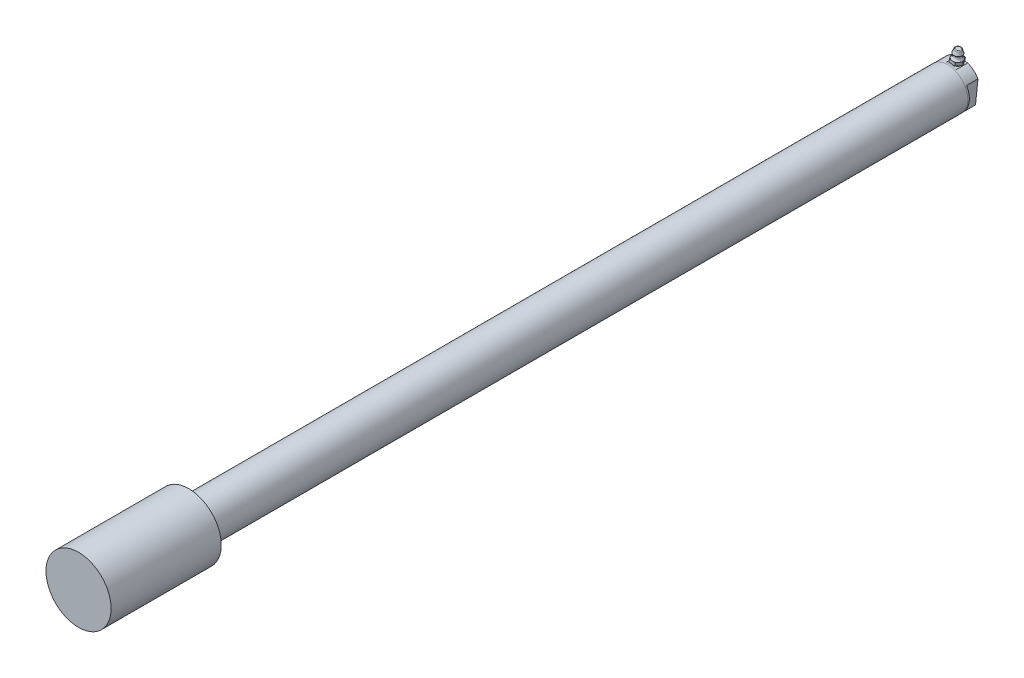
ISO-10303-21;
HEADER;
FILE_DESCRIPTION(('STEP AP214'),'2;1');
FILE_NAME('part.step','',(''),(''),'','','');
FILE_SCHEMA(('AUTOMOTIVE_DESIGN { 1 0 10303 214 1 1 1 1 }'));
ENDSEC;
DATA;
#1=APPLICATION_CONTEXT('core data for automotive mechanical design processes');
#2=APPLICATION_PROTOCOL_DEFINITION('international standard','automotive_design',2000,#1);
#3=PRODUCT_CONTEXT('',#1,'mechanical');
#4=PRODUCT('Part','Part','',(#3));
#5=PRODUCT_RELATED_PRODUCT_CATEGORY('part','',(#4));
#6=PRODUCT_DEFINITION_FORMATION('','',#4);
#7=PRODUCT_DEFINITION_CONTEXT('part definition',#1,'design');
#8=PRODUCT_DEFINITION('design','',#6,#7);
#9=PRODUCT_DEFINITION_SHAPE('','',#8);
#10=(LENGTH_UNIT() NAMED_UNIT(*) SI_UNIT(.MILLI.,.METRE.));
#11=(NAMED_UNIT(*) PLANE_ANGLE_UNIT() SI_UNIT($,.RADIAN.));
#12=(NAMED_UNIT(*) SI_UNIT($,.STERADIAN.) SOLID_ANGLE_UNIT());
#13=UNCERTAINTY_MEASURE_WITH_UNIT(LENGTH_MEASURE(1.E-05),#10,'distance_accuracy_value','');
#14=(GEOMETRIC_REPRESENTATION_CONTEXT(3) GLOBAL_UNCERTAINTY_ASSIGNED_CONTEXT((#13)) GLOBAL_UNIT_ASSIGNED_CONTEXT((#10,
#11,#12)) REPRESENTATION_CONTEXT('',''));
#15=CARTESIAN_POINT('',(0.,0.,0.));
#16=DIRECTION('',(0.,0.,1.));
#17=DIRECTION('',(1.,0.,0.));
#18=AXIS2_PLACEMENT_3D('',#15,#16,#17);
#19=CARTESIAN_POINT('',(0.,0.,614.74460000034));
#20=DIRECTION('',(0.,0.,-1.));
#21=DIRECTION('',(-1.,0.,0.));
#22=AXIS2_PLACEMENT_3D('',#19,#20,#21);
#23=CYLINDRICAL_SURFACE('',#22,15.8496);
#24=CARTESIAN_POINT('',(0.,0.,602.29860000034));
#25=DIRECTION('',(0.,0.,-1.));
#26=DIRECTION('',(-1.,0.,0.));
#27=AXIS2_PLACEMENT_3D('',#24,#25,#26);
#28=CIRCLE('',#27,15.8496);
#29=CARTESIAN_POINT('',(-15.8496,0.,602.29860000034));
#30=VERTEX_POINT('',#29);
#31=EDGE_CURVE('E861',#30,#30,#28,.F.);
#32=ORIENTED_EDGE('',*,*,#31,.F.);
#33=EDGE_LOOP('',(#32));
#34=FACE_BOUND('',#33,.T.);
#35=CARTESIAN_POINT('',(0.,0.,10.16));
#36=DIRECTION('',(0.,0.,-1.));
#37=DIRECTION('',(-1.,0.,0.));
#38=AXIS2_PLACEMENT_3D('',#35,#36,#37);
#39=CIRCLE('',#38,15.8496);
#40=CARTESIAN_POINT('',(-15.8496,0.,10.16));
#41=VERTEX_POINT('',#40);
#42=EDGE_CURVE('E858',#41,#41,#39,.T.);
#43=ORIENTED_EDGE('',*,*,#42,.F.);
#44=EDGE_LOOP('',(#43));
#45=FACE_BOUND('',#44,.T.);
#46=ADVANCED_FACE('F17',(#34,#45),#23,.T.);
#47=CARTESIAN_POINT('',(0.,0.,10.16));
#48=DIRECTION('',(0.,0.,-1.));
#49=DIRECTION('',(-1.,0.,0.));
#50=AXIS2_PLACEMENT_3D('',#47,#48,#49);
#51=PLANE('',#50);
#52=CARTESIAN_POINT('',(0.,0.,10.16));
#53=DIRECTION('',(0.,0.,-1.));
#54=DIRECTION('',(0.,1.,0.));
#55=AXIS2_PLACEMENT_3D('',#52,#53,#54);
#56=CIRCLE('',#55,15.7607);
#57=CARTESIAN_POINT('',(0.,15.7607,10.16));
#58=VERTEX_POINT('',#57);
#59=EDGE_CURVE('E10',#58,#58,#56,.T.);
#60=ORIENTED_EDGE('',*,*,#59,.F.);
#61=EDGE_LOOP('',(#60));
#62=FACE_BOUND('',#61,.T.);
#63=ORIENTED_EDGE('',*,*,#42,.T.);
#64=EDGE_LOOP('',(#63));
#65=FACE_BOUND('',#64,.T.);
#66=ADVANCED_FACE('F361',(#62,#65),#51,.T.);
#67=CARTESIAN_POINT('',(0.,0.,602.29860000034));
#68=DIRECTION('',(0.,0.,-1.));
#69=DIRECTION('',(-1.,0.,0.));
#70=AXIS2_PLACEMENT_3D('',#67,#68,#69);
#71=PLANE('',#70);
#72=ORIENTED_EDGE('',*,*,#31,.T.);
#73=EDGE_LOOP('',(#72));
#74=FACE_BOUND('',#73,.T.);
#75=CARTESIAN_POINT('',(0.,0.,602.29860000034));
#76=DIRECTION('',(0.,0.,-1.));
#77=DIRECTION('',(-1.,0.,0.));
#78=AXIS2_PLACEMENT_3D('',#75,#76,#77);
#79=CIRCLE('',#78,25.4);
#80=CARTESIAN_POINT('',(-25.4,0.,602.29860000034));
#81=VERTEX_POINT('',#80);
#82=EDGE_CURVE('E253',#81,#81,#79,.T.);
#83=ORIENTED_EDGE('',*,*,#82,.T.);
#84=EDGE_LOOP('',(#83));
#85=FACE_BOUND('',#84,.T.);
#86=ADVANCED_FACE('F372',(#74,#85),#71,.T.);
#87=CARTESIAN_POINT('',(0.,0.,688.28014000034));
#88=DIRECTION('',(0.,0.,1.));
#89=DIRECTION('',(1.,0.,0.));
#90=AXIS2_PLACEMENT_3D('',#87,#88,#89);
#91=PLANE('',#90);
#92=CARTESIAN_POINT('',(0.,0.,688.28014000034));
#93=DIRECTION('',(0.,0.,1.));
#94=DIRECTION('',(1.,0.,0.));
#95=AXIS2_PLACEMENT_3D('',#92,#93,#94);
#96=CIRCLE('',#95,25.4);
#97=CARTESIAN_POINT('',(25.4,0.,688.28014000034));
#98=VERTEX_POINT('',#97);
#99=EDGE_CURVE('E857',#98,#98,#96,.T.);
#100=ORIENTED_EDGE('',*,*,#99,.T.);
#101=EDGE_LOOP('',(#100));
#102=FACE_BOUND('',#101,.T.);
#103=ADVANCED_FACE('F379',(#102),#91,.T.);
#104=CARTESIAN_POINT('',(0.,0.,688.28014000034));
#105=DIRECTION('',(0.,0.,-1.));
#106=DIRECTION('',(-1.,0.,0.));
#107=AXIS2_PLACEMENT_3D('',#104,#105,#106);
#108=CYLINDRICAL_SURFACE('',#107,25.4);
#109=ORIENTED_EDGE('',*,*,#99,.F.);
#110=EDGE_LOOP('',(#109));
#111=FACE_BOUND('',#110,.T.);
#112=ORIENTED_EDGE('',*,*,#82,.F.);
#113=EDGE_LOOP('',(#112));
#114=FACE_BOUND('',#113,.T.);
#115=ADVANCED_FACE('F388',(#111,#114),#108,.T.);
#116=CARTESIAN_POINT('',(2.6550229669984,25.2608561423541,4.445));
#117=DIRECTION('',(0.104528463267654,0.994521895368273,0.));
#118=DIRECTION('',(0.,0.,1.));
#119=AXIS2_PLACEMENT_3D('',#116,#117,#118);
#120=PLANE('',#119);
#121=CARTESIAN_POINT('',(2.6550229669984,25.2608561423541,4.445));
#122=DIRECTION('',(0.104528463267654,0.994521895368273,0.));
#123=DIRECTION('',(0.,0.,1.));
#124=AXIS2_PLACEMENT_3D('',#121,#122,#123);
#125=CIRCLE('',#124,1.7474960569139);
#126=CARTESIAN_POINT('',(2.6550229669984,25.2608561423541,6.1924960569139));
#127=VERTEX_POINT('',#126);
#128=EDGE_CURVE('E244',#127,#127,#125,.T.);
#129=ORIENTED_EDGE('',*,*,#128,.T.);
#130=EDGE_LOOP('',(#129));
#131=FACE_BOUND('',#130,.T.);
#132=ADVANCED_FACE('F385',(#131),#120,.T.);
#133=CARTESIAN_POINT('',(2.57537227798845,24.5030304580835,4.445));
#134=DIRECTION('',(0.104528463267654,0.994521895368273,0.));
#135=DIRECTION('',(0.,0.,1.));
#136=AXIS2_PLACEMENT_3D('',#133,#134,#135);
#137=TOROIDAL_SURFACE('',#136,1.7474960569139,0.762);
#138=ORIENTED_EDGE('',*,*,#128,.F.);
#139=EDGE_LOOP('',(#138));
#140=FACE_BOUND('',#139,.T.);
#141=CARTESIAN_POINT('',(2.60196343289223,24.7560283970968,4.445));
#142=DIRECTION('',(0.104528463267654,0.994521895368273,0.));
#143=DIRECTION('',(0.,0.,1.));
#144=AXIS2_PLACEMENT_3D('',#141,#142,#143);
#145=CIRCLE('',#144,2.46577800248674);
#146=CARTESIAN_POINT('',(2.60196343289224,24.7560283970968,1.97922199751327));
#147=VERTEX_POINT('',#146);
#148=EDGE_CURVE('E241',#147,#147,#145,.F.);
#149=ORIENTED_EDGE('',*,*,#148,.F.);
#150=EDGE_LOOP('',(#149));
#151=FACE_BOUND('',#150,.T.);
#152=ADVANCED_FACE('F387',(#140,#151),#137,.T.);
#153=CARTESIAN_POINT('',(2.3364202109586,22.2295534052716,4.445));
#154=DIRECTION('',(-0.104528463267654,-0.994521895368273,0.));
#155=DIRECTION('',(0.,0.,-1.));
#156=AXIS2_PLACEMENT_3D('',#153,#154,#155);
#157=CONICAL_SURFACE('',#156,3.3655,0.340381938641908);
#158=CARTESIAN_POINT('',(2.3364202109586,22.2295534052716,4.445));
#159=DIRECTION('',(-0.104528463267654,-0.994521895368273,0.));
#160=DIRECTION('',(0.,0.,-1.));
#161=AXIS2_PLACEMENT_3D('',#158,#159,#160);
#162=CIRCLE('',#161,3.3655);
#163=CARTESIAN_POINT('',(2.3364202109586,22.2295534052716,1.0795));
#164=VERTEX_POINT('',#163);
#165=EDGE_CURVE('E194',#164,#164,#162,.T.);
#166=CARTESIAN_POINT('',(2.60196343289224,24.7560283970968,1.97922199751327));
#167=CARTESIAN_POINT('',(2.59919735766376,24.7297109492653,1.96984989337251));
#168=CARTESIAN_POINT('',(2.59643128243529,24.7033935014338,1.96047778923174));
#169=CARTESIAN_POINT('',(2.59089913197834,24.6507586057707,1.94173358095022));
#170=CARTESIAN_POINT('',(2.58813305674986,24.6244411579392,1.93236147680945));
#171=CARTESIAN_POINT('',(2.58260090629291,24.5718062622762,1.91361726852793));
#172=CARTESIAN_POINT('',(2.57983483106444,24.5454888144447,1.90424516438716));
#173=CARTESIAN_POINT('',(2.57430268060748,24.4928539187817,1.88550095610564));
#174=CARTESIAN_POINT('',(2.57153660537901,24.4665364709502,1.87612885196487));
#175=CARTESIAN_POINT('',(2.56600445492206,24.4139015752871,1.85738464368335));
#176=CARTESIAN_POINT('',(2.56323837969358,24.3875841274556,1.84801253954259));
#177=CARTESIAN_POINT('',(2.55770622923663,24.3349492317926,1.82926833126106));
#178=CARTESIAN_POINT('',(2.55494015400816,24.3086317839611,1.8198962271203));
#179=CARTESIAN_POINT('',(2.54940800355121,24.2559968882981,1.80115201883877));
#180=CARTESIAN_POINT('',(2.54664192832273,24.2296794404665,1.79177991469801));
#181=CARTESIAN_POINT('',(2.54110977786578,24.1770445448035,1.77303570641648));
#182=CARTESIAN_POINT('',(2.5383437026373,24.150727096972,1.76366360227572));
#183=CARTESIAN_POINT('',(2.53281155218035,24.098092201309,1.74491939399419));
#184=CARTESIAN_POINT('',(2.53004547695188,24.0717747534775,1.73554728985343));
#185=CARTESIAN_POINT('',(2.52451332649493,24.0191398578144,1.7168030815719));
#186=CARTESIAN_POINT('',(2.52174725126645,23.9928224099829,1.70743097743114));
#187=CARTESIAN_POINT('',(2.5162151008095,23.9401875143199,1.68868676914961));
#188=CARTESIAN_POINT('',(2.51344902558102,23.9138700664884,1.67931466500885));
#189=CARTESIAN_POINT('',(2.50791687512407,23.8612351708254,1.66057045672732));
#190=CARTESIAN_POINT('',(2.5051507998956,23.8349177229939,1.65119835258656));
#191=CARTESIAN_POINT('',(2.49961864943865,23.7822828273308,1.63245414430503));
#192=CARTESIAN_POINT('',(2.49685257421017,23.7559653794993,1.62308204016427));
#193=CARTESIAN_POINT('',(2.49132042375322,23.7033304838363,1.60433783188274));
#194=CARTESIAN_POINT('',(2.48855434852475,23.6770130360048,1.59496572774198));
#195=CARTESIAN_POINT('',(2.48302219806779,23.6243781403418,1.57622151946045));
#196=CARTESIAN_POINT('',(2.48025612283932,23.5980606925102,1.56684941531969));
#197=CARTESIAN_POINT('',(2.47472397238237,23.5454257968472,1.54810520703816));
#198=CARTESIAN_POINT('',(2.47195789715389,23.5191083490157,1.5387331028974));
#199=CARTESIAN_POINT('',(2.46642574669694,23.4664734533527,1.51998889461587));
#200=CARTESIAN_POINT('',(2.46365967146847,23.4401560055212,1.51061679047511));
#201=CARTESIAN_POINT('',(2.45812752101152,23.3875211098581,1.49187258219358));
#202=CARTESIAN_POINT('',(2.45536144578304,23.3612036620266,1.48250047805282));
#203=CARTESIAN_POINT('',(2.44982929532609,23.3085687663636,1.46375626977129));
#204=CARTESIAN_POINT('',(2.44706322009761,23.2822513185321,1.45438416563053));
#205=CARTESIAN_POINT('',(2.44153106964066,23.2296164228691,1.435639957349));
#206=CARTESIAN_POINT('',(2.43876499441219,23.2032989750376,1.42626785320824));
#207=CARTESIAN_POINT('',(2.43323284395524,23.1506640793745,1.40752364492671));
#208=CARTESIAN_POINT('',(2.43046676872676,23.124346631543,1.39815154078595));
#209=CARTESIAN_POINT('',(2.42493461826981,23.07171173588,1.37940733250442));
#210=CARTESIAN_POINT('',(2.42216854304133,23.0453942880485,1.37003522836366));
#211=CARTESIAN_POINT('',(2.41663639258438,22.9927593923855,1.35129102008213));
#212=CARTESIAN_POINT('',(2.41387031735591,22.9664419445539,1.34191891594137));
#213=CARTESIAN_POINT('',(2.40833816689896,22.9138070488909,1.32317470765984));
#214=CARTESIAN_POINT('',(2.40557209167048,22.8874896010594,1.31380260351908));
#215=CARTESIAN_POINT('',(2.40003994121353,22.8348547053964,1.29505839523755));
#216=CARTESIAN_POINT('',(2.39727386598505,22.8085372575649,1.28568629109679));
#217=CARTESIAN_POINT('',(2.3917417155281,22.7559023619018,1.26694208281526));
#218=CARTESIAN_POINT('',(2.38897564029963,22.7295849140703,1.2575699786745));
#219=CARTESIAN_POINT('',(2.38344348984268,22.6769500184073,1.23882577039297));
#220=CARTESIAN_POINT('',(2.3806774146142,22.6506325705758,1.22945366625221));
#221=CARTESIAN_POINT('',(2.37514526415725,22.5979976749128,1.21070945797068));
#222=CARTESIAN_POINT('',(2.37237918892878,22.5716802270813,1.20133735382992));
#223=CARTESIAN_POINT('',(2.36684703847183,22.5190453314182,1.1825931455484));
#224=CARTESIAN_POINT('',(2.36408096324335,22.4927278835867,1.17322104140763));
#225=CARTESIAN_POINT('',(2.3585488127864,22.4400929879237,1.15447683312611));
#226=CARTESIAN_POINT('',(2.35578273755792,22.4137755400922,1.14510472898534));
#227=CARTESIAN_POINT('',(2.35025058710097,22.3611406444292,1.12636052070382));
#228=CARTESIAN_POINT('',(2.3474845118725,22.3348231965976,1.11698841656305));
#229=CARTESIAN_POINT('',(2.34195236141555,22.2821883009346,1.09824420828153));
#230=CARTESIAN_POINT('',(2.33918628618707,22.2558708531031,1.08887210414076));
#231=CARTESIAN_POINT('',(2.3364202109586,22.2295534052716,1.0795));
#232=B_SPLINE_CURVE_WITH_KNOTS('',3,(#166,#167,#168,#169,#170,#171,#172,#173,#174,#175,#176,
#177,#178,#179,#180,#181,#182,#183,#184,#185,#186,#187,#188,#189,#190,#191,#192,#193,#194,#195,
#196,#197,#198,#199,#200,#201,#202,#203,#204,#205,#206,#207,#208,#209,#210,#211,#212,#213,#214,
#215,#216,#217,#218,#219,#220,#221,#222,#223,#224,#225,#226,#227,#228,#229,#230,#231),
.UNSPECIFIED.,.F.,.F.,(4,2,2,2,2,2,2,2,2,2,2,2,2,2,2,2,2,2,2,2,2,2,2,2,2,2,2,2,2,2,2,2,4),(0.,
0.0842191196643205,0.168438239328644,0.252657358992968,0.336876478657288,0.421095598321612,
0.505314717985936,0.589533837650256,0.67375295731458,0.757972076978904,0.842191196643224,
0.926410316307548,1.01062943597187,1.0948485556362,1.17906767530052,1.26328679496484,
1.34750591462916,1.43172503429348,1.51594415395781,1.60016327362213,1.68438239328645,
1.76860151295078,1.8528206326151,1.93703975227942,2.02125887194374,2.10547799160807,
2.18969711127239,2.27391623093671,2.35813535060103,2.44235447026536,2.52657358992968,
2.610792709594,2.69501182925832),.UNSPECIFIED.);
#233=EDGE_CURVE('BSEAM396',#147,#164,#232,.T.);
#234=ORIENTED_EDGE('',*,*,#148,.T.);
#235=ORIENTED_EDGE('',*,*,#165,.F.);
#236=ORIENTED_EDGE('',*,*,#233,.T.);
#237=ORIENTED_EDGE('',*,*,#233,.F.);
#238=EDGE_LOOP('',(#234,#236,#235,#237));
#239=FACE_BOUND('',#238,.T.);
#240=ADVANCED_FACE('F396',(#239),#157,.T.);
#241=CARTESIAN_POINT('',(2.1693513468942,20.63999934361,4.445));
#242=DIRECTION('',(-0.104528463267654,-0.994521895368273,0.));
#243=DIRECTION('',(0.,0.,-1.));
#244=AXIS2_PLACEMENT_3D('',#241,#242,#243);
#245=TOROIDAL_SURFACE('',#244,5.20693450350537,2.43833450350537);
#246=ORIENTED_EDGE('',*,*,#165,.T.);
#247=EDGE_LOOP('',(#246));
#248=FACE_BOUND('',#247,.T.);
#249=CARTESIAN_POINT('',(1.94978249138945,18.5509412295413,4.445));
#250=DIRECTION('',(-0.104528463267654,-0.994521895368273,0.));
#251=DIRECTION('',(0.,0.,-1.));
#252=AXIS2_PLACEMENT_3D('',#249,#250,#251);
#253=CIRCLE('',#252,3.96875);
#254=CARTESIAN_POINT('',(1.94978249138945,18.5509412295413,0.47625));
#255=VERTEX_POINT('',#254);
#256=CARTESIAN_POINT('',(5.36799235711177,18.191672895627,2.460625));
#257=VERTEX_POINT('',#256);
#258=EDGE_CURVE('E43',#255,#257,#253,.T.);
#259=ORIENTED_EDGE('',*,*,#258,.F.);
#260=CARTESIAN_POINT('',(-1.46842737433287,18.9102095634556,2.460625));
#261=VERTEX_POINT('',#260);
#262=EDGE_CURVE('E190',#261,#255,#253,.T.);
#263=ORIENTED_EDGE('',*,*,#262,.F.);
#264=CARTESIAN_POINT('',(-1.46842737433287,18.9102095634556,6.429375));
#265=VERTEX_POINT('',#264);
#266=EDGE_CURVE('E189',#265,#261,#253,.T.);
#267=ORIENTED_EDGE('',*,*,#266,.F.);
#268=CARTESIAN_POINT('',(1.94978249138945,18.5509412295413,8.41375));
#269=VERTEX_POINT('',#268);
#270=EDGE_CURVE('E169',#269,#265,#253,.T.);
#271=ORIENTED_EDGE('',*,*,#270,.F.);
#272=CARTESIAN_POINT('',(5.36799235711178,18.191672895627,6.429375));
#273=VERTEX_POINT('',#272);
#274=EDGE_CURVE('E158',#273,#269,#253,.T.);
#275=ORIENTED_EDGE('',*,*,#274,.F.);
#276=EDGE_CURVE('E168',#257,#273,#253,.T.);
#277=ORIENTED_EDGE('',*,*,#276,.F.);
#278=EDGE_LOOP('',(#259,#263,#267,#271,#275,#277));
#279=FACE_BOUND('',#278,.T.);
#280=ADVANCED_FACE('F187',(#248,#279),#245,.F.);
#281=CARTESIAN_POINT('',(-0.329024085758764,18.7904534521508,0.47625));
#282=DIRECTION('',(0.104528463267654,0.994521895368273,0.));
#283=DIRECTION('',(0.994521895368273,-0.104528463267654,0.));
#284=AXIS2_PLACEMENT_3D('',#281,#282,#283);
#285=PLANE('',#284);
#286=ORIENTED_EDGE('',*,*,#266,.T.);
#287=DIRECTION('',(-0.497260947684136,0.0522642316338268,0.866025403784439));
#288=VECTOR('',#287,1.);
#289=CARTESIAN_POINT('',(-0.329024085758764,18.7904534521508,0.47625));
#290=LINE('',#289,#288);
#291=CARTESIAN_POINT('',(-2.60783066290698,19.0299656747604,4.445));
#292=VERTEX_POINT('',#291);
#293=EDGE_CURVE('E203',#261,#292,#290,.T.);
#294=ORIENTED_EDGE('',*,*,#293,.T.);
#295=DIRECTION('',(0.497260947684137,-0.0522642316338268,0.866025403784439));
#296=VECTOR('',#295,1.);
#297=CARTESIAN_POINT('',(-2.60783066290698,19.0299656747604,4.445));
#298=LINE('',#297,#296);
#299=EDGE_CURVE('E114',#292,#265,#298,.T.);
#300=ORIENTED_EDGE('',*,*,#299,.T.);
#301=EDGE_LOOP('',(#286,#294,#300));
#302=FACE_BOUND('',#301,.T.);
#303=ADVANCED_FACE('F405',(#302),#285,.T.);
#304=ORIENTED_EDGE('',*,*,#270,.T.);
#305=CARTESIAN_POINT('',(-0.329024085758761,18.7904534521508,8.41375));
#306=VERTEX_POINT('',#305);
#307=EDGE_CURVE('E184',#265,#306,#298,.T.);
#308=ORIENTED_EDGE('',*,*,#307,.T.);
#309=DIRECTION('',(0.994521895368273,-0.104528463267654,0.));
#310=VECTOR('',#309,1.);
#311=CARTESIAN_POINT('',(-0.329024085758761,18.7904534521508,8.41375));
#312=LINE('',#311,#310);
#313=EDGE_CURVE('E176',#306,#269,#312,.T.);
#314=ORIENTED_EDGE('',*,*,#313,.T.);
#315=EDGE_LOOP('',(#304,#308,#314));
#316=FACE_BOUND('',#315,.T.);
#317=ADVANCED_FACE('F182',(#316),#285,.T.);
#318=ORIENTED_EDGE('',*,*,#274,.T.);
#319=CARTESIAN_POINT('',(4.22858906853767,18.3114290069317,8.41375));
#320=VERTEX_POINT('',#319);
#321=EDGE_CURVE('E161',#269,#320,#312,.T.);
#322=ORIENTED_EDGE('',*,*,#321,.T.);
#323=DIRECTION('',(0.497260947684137,-0.0522642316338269,-0.866025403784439));
#324=VECTOR('',#323,1.);
#325=CARTESIAN_POINT('',(4.22858906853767,18.3114290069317,8.41375));
#326=LINE('',#325,#324);
#327=EDGE_CURVE('E164',#320,#273,#326,.T.);
#328=ORIENTED_EDGE('',*,*,#327,.T.);
#329=EDGE_LOOP('',(#318,#322,#328));
#330=FACE_BOUND('',#329,.T.);
#331=ADVANCED_FACE('F160',(#330),#285,.T.);
#332=ORIENTED_EDGE('',*,*,#276,.T.);
#333=CARTESIAN_POINT('',(6.50739564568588,18.0719167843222,4.445));
#334=VERTEX_POINT('',#333);
#335=EDGE_CURVE('E186',#273,#334,#326,.T.);
#336=ORIENTED_EDGE('',*,*,#335,.T.);
#337=DIRECTION('',(-0.497260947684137,0.0522642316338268,-0.866025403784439));
#338=VECTOR('',#337,1.);
#339=CARTESIAN_POINT('',(6.50739564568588,18.0719167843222,4.445));
#340=LINE('',#339,#338);
#341=EDGE_CURVE('E211',#334,#257,#340,.T.);
#342=ORIENTED_EDGE('',*,*,#341,.T.);
#343=EDGE_LOOP('',(#332,#336,#342));
#344=FACE_BOUND('',#343,.T.);
#345=ADVANCED_FACE('F774',(#344),#285,.T.);
#346=ORIENTED_EDGE('',*,*,#258,.T.);
#347=CARTESIAN_POINT('',(4.22858906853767,18.3114290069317,0.47625));
#348=VERTEX_POINT('',#347);
#349=EDGE_CURVE('E210',#257,#348,#340,.T.);
#350=ORIENTED_EDGE('',*,*,#349,.T.);
#351=DIRECTION('',(-0.994521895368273,0.104528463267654,0.));
#352=VECTOR('',#351,1.);
#353=CARTESIAN_POINT('',(4.22858906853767,18.3114290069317,0.47625));
#354=LINE('',#353,#352);
#355=EDGE_CURVE('E201',#348,#255,#354,.T.);
#356=ORIENTED_EDGE('',*,*,#355,.T.);
#357=EDGE_LOOP('',(#346,#350,#356));
#358=FACE_BOUND('',#357,.T.);
#359=ADVANCED_FACE('F766',(#358),#285,.T.);
#360=ORIENTED_EDGE('',*,*,#262,.T.);
#361=CARTESIAN_POINT('',(-0.329024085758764,18.7904534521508,0.47625));
#362=VERTEX_POINT('',#361);
#363=EDGE_CURVE('E204',#255,#362,#354,.T.);
#364=ORIENTED_EDGE('',*,*,#363,.T.);
#365=EDGE_CURVE('E205',#362,#261,#290,.T.);
#366=ORIENTED_EDGE('',*,*,#365,.T.);
#367=EDGE_LOOP('',(#360,#364,#366));
#368=FACE_BOUND('',#367,.T.);
#369=ADVANCED_FACE('F408',(#368),#285,.T.);
#370=CARTESIAN_POINT('',(-0.329024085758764,18.7904534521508,0.47625));
#371=DIRECTION('',(0.861281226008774,-0.0905243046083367,0.5));
#372=DIRECTION('',(0.497260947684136,-0.0522642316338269,-0.866025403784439));
#373=AXIS2_PLACEMENT_3D('',#370,#371,#372);
#374=PLANE('',#373);
#375=DIRECTION('',(-0.497260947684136,0.0522642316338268,0.866025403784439));
#376=VECTOR('',#375,1.);
#377=CARTESIAN_POINT('',(-0.577932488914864,16.4222481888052,0.47625));
#378=LINE('',#377,#376);
#379=CARTESIAN_POINT('',(-0.577932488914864,16.4222481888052,0.47625));
#380=VERTEX_POINT('',#379);
#381=CARTESIAN_POINT('',(-2.85673906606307,16.6617604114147,4.445));
#382=VERTEX_POINT('',#381);
#383=EDGE_CURVE('E217',#380,#382,#378,.T.);
#384=ORIENTED_EDGE('',*,*,#383,.T.);
#385=DIRECTION('',(-0.104528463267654,-0.994521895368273,0.));
#386=VECTOR('',#385,1.);
#387=CARTESIAN_POINT('',(-2.60783066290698,19.0299656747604,4.445));
#388=LINE('',#387,#386);
#389=EDGE_CURVE('E235',#292,#382,#388,.T.);
#390=ORIENTED_EDGE('',*,*,#389,.F.);
#391=ORIENTED_EDGE('',*,*,#293,.F.);
#392=ORIENTED_EDGE('',*,*,#365,.F.);
#393=DIRECTION('',(-0.104528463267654,-0.994521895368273,0.));
#394=VECTOR('',#393,1.);
#395=CARTESIAN_POINT('',(-0.329024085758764,18.7904534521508,0.47625));
#396=LINE('',#395,#394);
#397=EDGE_CURVE('E238',#362,#380,#396,.T.);
#398=ORIENTED_EDGE('',*,*,#397,.T.);
#399=EDGE_LOOP('',(#384,#390,#391,#392,#398));
#400=FACE_BOUND('',#399,.T.);
#401=ADVANCED_FACE('F427',(#400),#374,.F.);
#402=CARTESIAN_POINT('',(-2.60783066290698,19.0299656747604,4.445));
#403=DIRECTION('',(0.861281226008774,-0.0905243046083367,-0.5));
#404=DIRECTION('',(-0.497260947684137,0.0522642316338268,-0.866025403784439));
#405=AXIS2_PLACEMENT_3D('',#402,#403,#404);
#406=PLANE('',#405);
#407=DIRECTION('',(0.497260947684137,-0.0522642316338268,0.866025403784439));
#408=VECTOR('',#407,1.);
#409=CARTESIAN_POINT('',(-2.85673906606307,16.6617604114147,4.445));
#410=LINE('',#409,#408);
#411=CARTESIAN_POINT('',(-0.577932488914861,16.4222481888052,8.41375));
#412=VERTEX_POINT('',#411);
#413=EDGE_CURVE('E219',#382,#412,#410,.T.);
#414=ORIENTED_EDGE('',*,*,#413,.T.);
#415=DIRECTION('',(-0.104528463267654,-0.994521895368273,0.));
#416=VECTOR('',#415,1.);
#417=CARTESIAN_POINT('',(-0.329024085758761,18.7904534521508,8.41375));
#418=LINE('',#417,#416);
#419=EDGE_CURVE('E233',#306,#412,#418,.T.);
#420=ORIENTED_EDGE('',*,*,#419,.F.);
#421=ORIENTED_EDGE('',*,*,#307,.F.);
#422=ORIENTED_EDGE('',*,*,#299,.F.);
#423=ORIENTED_EDGE('',*,*,#389,.T.);
#424=EDGE_LOOP('',(#414,#420,#421,#422,#423));
#425=FACE_BOUND('',#424,.T.);
#426=ADVANCED_FACE('F424',(#425),#406,.F.);
#427=CARTESIAN_POINT('',(-0.329024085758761,18.7904534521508,8.41375));
#428=DIRECTION('',(0.,0.,-1.));
#429=DIRECTION('',(-0.994521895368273,0.104528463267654,0.));
#430=AXIS2_PLACEMENT_3D('',#427,#428,#429);
#431=PLANE('',#430);
#432=DIRECTION('',(0.994521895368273,-0.104528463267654,0.));
#433=VECTOR('',#432,1.);
#434=CARTESIAN_POINT('',(-0.577932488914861,16.4222481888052,8.41375));
#435=LINE('',#434,#433);
#436=CARTESIAN_POINT('',(3.97968066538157,15.9432237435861,8.41375));
#437=VERTEX_POINT('',#436);
#438=EDGE_CURVE('E221',#412,#437,#435,.T.);
#439=ORIENTED_EDGE('',*,*,#438,.T.);
#440=DIRECTION('',(-0.104528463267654,-0.994521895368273,0.));
#441=VECTOR('',#440,1.);
#442=CARTESIAN_POINT('',(4.22858906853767,18.3114290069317,8.41375));
#443=LINE('',#442,#441);
#444=EDGE_CURVE('E178',#320,#437,#443,.T.);
#445=ORIENTED_EDGE('',*,*,#444,.F.);
#446=ORIENTED_EDGE('',*,*,#321,.F.);
#447=ORIENTED_EDGE('',*,*,#313,.F.);
#448=ORIENTED_EDGE('',*,*,#419,.T.);
#449=EDGE_LOOP('',(#439,#445,#446,#447,#448));
#450=FACE_BOUND('',#449,.T.);
#451=ADVANCED_FACE('F174',(#450),#431,.F.);
#452=CARTESIAN_POINT('',(4.22858906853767,18.3114290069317,8.41375));
#453=DIRECTION('',(-0.861281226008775,0.0905243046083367,-0.5));
#454=DIRECTION('',(-0.497260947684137,0.0522642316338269,0.866025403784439));
#455=AXIS2_PLACEMENT_3D('',#452,#453,#454);
#456=PLANE('',#455);
#457=DIRECTION('',(0.497260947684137,-0.0522642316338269,-0.866025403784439));
#458=VECTOR('',#457,1.);
#459=CARTESIAN_POINT('',(3.97968066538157,15.9432237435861,8.41375));
#460=LINE('',#459,#458);
#461=CARTESIAN_POINT('',(6.25848724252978,15.7037115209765,4.445));
#462=VERTEX_POINT('',#461);
#463=EDGE_CURVE('E223',#437,#462,#460,.T.);
#464=ORIENTED_EDGE('',*,*,#463,.T.);
#465=DIRECTION('',(-0.104528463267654,-0.994521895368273,0.));
#466=VECTOR('',#465,1.);
#467=CARTESIAN_POINT('',(6.50739564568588,18.0719167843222,4.445));
#468=LINE('',#467,#466);
#469=EDGE_CURVE('E229',#334,#462,#468,.T.);
#470=ORIENTED_EDGE('',*,*,#469,.F.);
#471=ORIENTED_EDGE('',*,*,#335,.F.);
#472=ORIENTED_EDGE('',*,*,#327,.F.);
#473=ORIENTED_EDGE('',*,*,#444,.T.);
#474=EDGE_LOOP('',(#464,#470,#471,#472,#473));
#475=FACE_BOUND('',#474,.T.);
#476=ADVANCED_FACE('F417',(#475),#456,.F.);
#477=CARTESIAN_POINT('',(6.50739564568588,18.0719167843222,4.445));
#478=DIRECTION('',(-0.861281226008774,0.0905243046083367,0.5));
#479=DIRECTION('',(0.497260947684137,-0.0522642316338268,0.866025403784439));
#480=AXIS2_PLACEMENT_3D('',#477,#478,#479);
#481=PLANE('',#480);
#482=DIRECTION('',(-0.497260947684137,0.0522642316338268,-0.866025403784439));
#483=VECTOR('',#482,1.);
#484=CARTESIAN_POINT('',(6.25848724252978,15.7037115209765,4.445));
#485=LINE('',#484,#483);
#486=CARTESIAN_POINT('',(3.97968066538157,15.9432237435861,0.47625));
#487=VERTEX_POINT('',#486);
#488=EDGE_CURVE('E225',#462,#487,#485,.T.);
#489=ORIENTED_EDGE('',*,*,#488,.T.);
#490=DIRECTION('',(-0.104528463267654,-0.994521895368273,0.));
#491=VECTOR('',#490,1.);
#492=CARTESIAN_POINT('',(4.22858906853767,18.3114290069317,0.47625));
#493=LINE('',#492,#491);
#494=EDGE_CURVE('E214',#348,#487,#493,.T.);
#495=ORIENTED_EDGE('',*,*,#494,.F.);
#496=ORIENTED_EDGE('',*,*,#349,.F.);
#497=ORIENTED_EDGE('',*,*,#341,.F.);
#498=ORIENTED_EDGE('',*,*,#469,.T.);
#499=EDGE_LOOP('',(#489,#495,#496,#497,#498));
#500=FACE_BOUND('',#499,.T.);
#501=ADVANCED_FACE('F414',(#500),#481,.F.);
#502=CARTESIAN_POINT('',(4.22858906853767,18.3114290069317,0.47625));
#503=DIRECTION('',(0.,0.,1.));
#504=DIRECTION('',(-0.104528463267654,-0.994521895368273,0.));
#505=AXIS2_PLACEMENT_3D('',#502,#503,#504);
#506=PLANE('',#505);
#507=DIRECTION('',(-0.994521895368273,0.104528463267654,0.));
#508=VECTOR('',#507,1.);
#509=CARTESIAN_POINT('',(3.97968066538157,15.9432237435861,0.47625));
#510=LINE('',#509,#508);
#511=EDGE_CURVE('E200',#487,#380,#510,.T.);
#512=ORIENTED_EDGE('',*,*,#511,.T.);
#513=ORIENTED_EDGE('',*,*,#397,.F.);
#514=ORIENTED_EDGE('',*,*,#363,.F.);
#515=ORIENTED_EDGE('',*,*,#355,.F.);
#516=ORIENTED_EDGE('',*,*,#494,.T.);
#517=EDGE_LOOP('',(#512,#513,#514,#515,#516));
#518=FACE_BOUND('',#517,.T.);
#519=ADVANCED_FACE('F412',(#518),#506,.F.);
#520=CARTESIAN_POINT('',(-0.577932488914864,16.4222481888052,0.47625));
#521=DIRECTION('',(0.104528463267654,0.994521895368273,0.));
#522=DIRECTION('',(0.994521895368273,-0.104528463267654,0.));
#523=AXIS2_PLACEMENT_3D('',#520,#521,#522);
#524=PLANE('',#523);
#525=CARTESIAN_POINT('',(1.70087408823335,16.1827359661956,4.445));
#526=DIRECTION('',(-0.104528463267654,-0.994521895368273,0.));
#527=DIRECTION('',(0.,0.,-1.));
#528=AXIS2_PLACEMENT_3D('',#525,#526,#527);
#529=CIRCLE('',#528,3.2385);
#530=CARTESIAN_POINT('',(1.70087408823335,16.1827359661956,1.2065));
#531=VERTEX_POINT('',#530);
#532=EDGE_CURVE('E193',#531,#531,#529,.T.);
#533=ORIENTED_EDGE('',*,*,#532,.F.);
#534=EDGE_LOOP('',(#533));
#535=FACE_BOUND('',#534,.T.);
#536=ORIENTED_EDGE('',*,*,#511,.F.);
#537=ORIENTED_EDGE('',*,*,#488,.F.);
#538=ORIENTED_EDGE('',*,*,#463,.F.);
#539=ORIENTED_EDGE('',*,*,#438,.F.);
#540=ORIENTED_EDGE('',*,*,#413,.F.);
#541=ORIENTED_EDGE('',*,*,#383,.F.);
#542=EDGE_LOOP('',(#536,#537,#538,#539,#540,#541));
#543=FACE_BOUND('',#542,.T.);
#544=ADVANCED_FACE('F409',(#535,#543),#524,.F.);
#545=CARTESIAN_POINT('',(0.995633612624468,9.47282105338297,0.889));
#546=DIRECTION('',(0.,1.,0.));
#547=DIRECTION('',(1.,0.,0.));
#548=AXIS2_PLACEMENT_3D('',#545,#546,#547);
#549=SPHERICAL_SURFACE('',#548,0.8382);
#550=CARTESIAN_POINT('',(0.995633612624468,9.47282105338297,0.889));
#551=DIRECTION('',(0.,0.,1.));
#552=DIRECTION('',(1.,0.,0.));
#553=AXIS2_PLACEMENT_3D('',#550,#551,#552);
#554=SPHERICAL_SURFACE('',#553,0.8382);
#555=CARTESIAN_POINT('',(0.995633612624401,9.4728210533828,0.619667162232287));
#556=DIRECTION('',(0.,0.,1.));
#557=DIRECTION('',(1.,0.,0.));
#558=AXIS2_PLACEMENT_3D('',#555,#556,#557);
#559=CIRCLE('',#558,0.79375);
#560=CARTESIAN_POINT('',(1.7893836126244,9.4728210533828,0.619667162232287));
#561=VERTEX_POINT('',#560);
#562=EDGE_CURVE('E257',#561,#561,#559,.T.);
#563=ORIENTED_EDGE('',*,*,#562,.F.);
#564=EDGE_LOOP('',(#563));
#565=FACE_BOUND('',#564,.T.);
#566=ADVANCED_FACE('F333',(#565),#554,.T.);
#567=CARTESIAN_POINT('',(0.,0.,33.0708));
#568=DIRECTION('',(0.,0.,-1.));
#569=DIRECTION('',(0.104528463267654,0.994521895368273,0.));
#570=AXIS2_PLACEMENT_3D('',#567,#568,#569);
#571=CONICAL_SURFACE('',#570,7.25,1.02974425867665);
#572=CARTESIAN_POINT('',(0.,0.,37.4270394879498));
#573=VERTEX_POINT('',#572);
#574=VERTEX_LOOP('',#573);
#575=FACE_BOUND('',#574,.T.);
#576=CARTESIAN_POINT('',(0.,0.,33.0708));
#577=DIRECTION('',(0.,0.,-1.));
#578=DIRECTION('',(0.104528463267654,0.994521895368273,0.));
#579=AXIS2_PLACEMENT_3D('',#576,#577,#578);
#580=CIRCLE('',#579,7.25);
#581=CARTESIAN_POINT('',(0.757831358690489,7.21028374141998,33.0708));
#582=VERTEX_POINT('',#581);
#583=EDGE_CURVE('E263',#582,#582,#580,.T.);
#584=ORIENTED_EDGE('',*,*,#583,.T.);
#585=EDGE_LOOP('',(#584));
#586=FACE_BOUND('',#585,.T.);
#587=ADVANCED_FACE('F335',(#575,#586),#571,.F.);
#588=CARTESIAN_POINT('',(1.70087408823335,16.1827359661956,4.445));
#589=DIRECTION('',(-0.104528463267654,-0.994521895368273,0.));
#590=DIRECTION('',(0.,0.,-1.));
#591=AXIS2_PLACEMENT_3D('',#588,#589,#590);
#592=CYLINDRICAL_SURFACE('',#591,3.2385);
#593=CARTESIAN_POINT('',(1.64777362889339,15.6775188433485,4.445));
#594=DIRECTION('',(-0.104528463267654,-0.994521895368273,0.));
#595=DIRECTION('',(0.,0.,-1.));
#596=AXIS2_PLACEMENT_3D('',#593,#594,#595);
#597=CIRCLE('',#596,3.2385);
#598=CARTESIAN_POINT('',(1.64777362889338,15.6775188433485,1.2065));
#599=VERTEX_POINT('',#598);
#600=EDGE_CURVE('E197',#599,#599,#597,.T.);
#601=CARTESIAN_POINT('',(1.70087408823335,16.1827359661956,1.2065));
#602=CARTESIAN_POINT('',(1.70032095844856,16.1774732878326,1.2065));
#603=CARTESIAN_POINT('',(1.69976782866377,16.1722106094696,1.2065));
#604=CARTESIAN_POINT('',(1.69866156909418,16.1616852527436,1.2065));
#605=CARTESIAN_POINT('',(1.69810843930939,16.1564225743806,1.2065));
#606=CARTESIAN_POINT('',(1.69700217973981,16.1458972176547,1.2065));
#607=CARTESIAN_POINT('',(1.69644904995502,16.1406345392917,1.2065));
#608=CARTESIAN_POINT('',(1.69534279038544,16.1301091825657,1.2065));
#609=CARTESIAN_POINT('',(1.69478966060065,16.1248465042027,1.2065));
#610=CARTESIAN_POINT('',(1.69368340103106,16.1143211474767,1.2065));
#611=CARTESIAN_POINT('',(1.69313027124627,16.1090584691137,1.2065));
#612=CARTESIAN_POINT('',(1.69202401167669,16.0985331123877,1.2065));
#613=CARTESIAN_POINT('',(1.6914708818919,16.0932704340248,1.2065));
#614=CARTESIAN_POINT('',(1.69036462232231,16.0827450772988,1.2065));
#615=CARTESIAN_POINT('',(1.68981149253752,16.0774823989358,1.2065));
#616=CARTESIAN_POINT('',(1.68870523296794,16.0669570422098,1.2065));
#617=CARTESIAN_POINT('',(1.68815210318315,16.0616943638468,1.2065));
#618=CARTESIAN_POINT('',(1.68704584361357,16.0511690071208,1.2065));
#619=CARTESIAN_POINT('',(1.68649271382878,16.0459063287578,1.2065));
#620=CARTESIAN_POINT('',(1.68538645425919,16.0353809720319,1.2065));
#621=CARTESIAN_POINT('',(1.6848333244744,16.0301182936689,1.2065));
#622=CARTESIAN_POINT('',(1.68372706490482,16.0195929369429,1.2065));
#623=CARTESIAN_POINT('',(1.68317393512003,16.0143302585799,1.2065));
#624=CARTESIAN_POINT('',(1.68206767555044,16.0038049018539,1.2065));
#625=CARTESIAN_POINT('',(1.68151454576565,15.9985422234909,1.2065));
#626=CARTESIAN_POINT('',(1.68040828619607,15.9880168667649,1.2065));
#627=CARTESIAN_POINT('',(1.67985515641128,15.982754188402,1.2065));
#628=CARTESIAN_POINT('',(1.6787488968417,15.972228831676,1.2065));
#629=CARTESIAN_POINT('',(1.6781957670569,15.966966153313,1.2065));
#630=CARTESIAN_POINT('',(1.67708950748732,15.956440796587,1.2065));
#631=CARTESIAN_POINT('',(1.67653637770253,15.951178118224,1.2065));
#632=CARTESIAN_POINT('',(1.67543011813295,15.940652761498,1.2065));
#633=CARTESIAN_POINT('',(1.67487698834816,15.935390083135,1.2065));
#634=CARTESIAN_POINT('',(1.67377072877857,15.9248647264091,1.2065));
#635=CARTESIAN_POINT('',(1.67321759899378,15.9196020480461,1.2065));
#636=CARTESIAN_POINT('',(1.6721113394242,15.9090766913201,1.2065));
#637=CARTESIAN_POINT('',(1.67155820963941,15.9038140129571,1.2065));
#638=CARTESIAN_POINT('',(1.67045195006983,15.8932886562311,1.2065));
#639=CARTESIAN_POINT('',(1.66989882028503,15.8880259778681,1.2065));
#640=CARTESIAN_POINT('',(1.66879256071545,15.8775006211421,1.2065));
#641=CARTESIAN_POINT('',(1.66823943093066,15.8722379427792,1.2065));
#642=CARTESIAN_POINT('',(1.66713317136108,15.8617125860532,1.2065));
#643=CARTESIAN_POINT('',(1.66658004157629,15.8564499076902,1.2065));
#644=CARTESIAN_POINT('',(1.6654737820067,15.8459245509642,1.2065));
#645=CARTESIAN_POINT('',(1.66492065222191,15.8406618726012,1.2065));
#646=CARTESIAN_POINT('',(1.66381439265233,15.8301365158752,1.2065));
#647=CARTESIAN_POINT('',(1.66326126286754,15.8248738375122,1.2065));
#648=CARTESIAN_POINT('',(1.66215500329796,15.8143484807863,1.2065));
#649=CARTESIAN_POINT('',(1.66160187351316,15.8090858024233,1.2065));
#650=CARTESIAN_POINT('',(1.66049561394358,15.7985604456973,1.2065));
#651=CARTESIAN_POINT('',(1.65994248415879,15.7932977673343,1.2065));
#652=CARTESIAN_POINT('',(1.65883622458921,15.7827724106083,1.2065));
#653=CARTESIAN_POINT('',(1.65828309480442,15.7775097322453,1.2065));
#654=CARTESIAN_POINT('',(1.65717683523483,15.7669843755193,1.2065));
#655=CARTESIAN_POINT('',(1.65662370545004,15.7617216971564,1.2065));
#656=CARTESIAN_POINT('',(1.65551744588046,15.7511963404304,1.2065));
#657=CARTESIAN_POINT('',(1.65496431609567,15.7459336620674,1.2065));
#658=CARTESIAN_POINT('',(1.65385805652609,15.7354083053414,1.2065));
#659=CARTESIAN_POINT('',(1.65330492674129,15.7301456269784,1.2065));
#660=CARTESIAN_POINT('',(1.65219866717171,15.7196202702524,1.2065));
#661=CARTESIAN_POINT('',(1.65164553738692,15.7143575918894,1.2065));
#662=CARTESIAN_POINT('',(1.65053927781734,15.7038322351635,1.2065));
#663=CARTESIAN_POINT('',(1.64998614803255,15.6985695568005,1.2065));
#664=CARTESIAN_POINT('',(1.64887988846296,15.6880442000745,1.2065));
#665=CARTESIAN_POINT('',(1.64832675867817,15.6827815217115,1.2065));
#666=CARTESIAN_POINT('',(1.64777362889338,15.6775188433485,1.2065));
#667=B_SPLINE_CURVE_WITH_KNOTS('',3,(#601,#602,#603,#604,#605,#606,#607,#608,#609,#610,#611,
#612,#613,#614,#615,#616,#617,#618,#619,#620,#621,#622,#623,#624,#625,#626,#627,#628,#629,#630,
#631,#632,#633,#634,#635,#636,#637,#638,#639,#640,#641,#642,#643,#644,#645,#646,#647,#648,#649,
#650,#651,#652,#653,#654,#655,#656,#657,#658,#659,#660,#661,#662,#663,#664,#665,#666),
.UNSPECIFIED.,.F.,.F.,(4,2,2,2,2,2,2,2,2,2,2,2,2,2,2,2,2,2,2,2,2,2,2,2,2,2,2,2,2,2,2,2,4),(0.,
0.0158749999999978,0.0317499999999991,0.0476250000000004,0.0635000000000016,0.0793749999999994,
0.0952500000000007,0.111125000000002,0.127000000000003,0.142875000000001,0.158750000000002,
0.174625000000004,0.190500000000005,0.206375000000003,0.222250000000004,0.238125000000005,
0.254000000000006,0.269875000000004,0.285750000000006,0.301625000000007,0.317500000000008,
0.333375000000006,0.349250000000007,0.365125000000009,0.38100000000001,0.396875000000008,
0.412750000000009,0.42862500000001,0.444500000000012,0.460375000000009,0.476250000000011,
0.492125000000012,0.508000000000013),.UNSPECIFIED.);
#668=EDGE_CURVE('BSEAM330',#531,#599,#667,.T.);
#669=ORIENTED_EDGE('',*,*,#532,.T.);
#670=ORIENTED_EDGE('',*,*,#600,.F.);
#671=ORIENTED_EDGE('',*,*,#668,.T.);
#672=ORIENTED_EDGE('',*,*,#668,.F.);
#673=EDGE_LOOP('',(#669,#671,#670,#672));
#674=FACE_BOUND('',#673,.T.);
#675=ADVANCED_FACE('F330',(#674),#592,.T.);
#676=CARTESIAN_POINT('',(0.995633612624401,9.4728210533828,0.));
#677=DIRECTION('',(0.,0.,-1.));
#678=DIRECTION('',(0.104528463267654,0.994521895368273,0.));
#679=AXIS2_PLACEMENT_3D('',#676,#677,#678);
#680=CYLINDRICAL_SURFACE('',#679,0.79375);
#681=CARTESIAN_POINT('',(0.995633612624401,9.4728210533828,0.));
#682=DIRECTION('',(0.,0.,-1.));
#683=DIRECTION('',(0.104528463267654,0.994521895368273,0.));
#684=AXIS2_PLACEMENT_3D('',#681,#682,#683);
#685=CIRCLE('',#684,0.79375);
#686=CARTESIAN_POINT('',(1.0786030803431,10.2622228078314,0.));
#687=VERTEX_POINT('',#686);
#688=EDGE_CURVE('E266',#687,#687,#685,.T.);
#689=ORIENTED_EDGE('',*,*,#688,.T.);
#690=EDGE_LOOP('',(#689));
#691=FACE_BOUND('',#690,.T.);
#692=ORIENTED_EDGE('',*,*,#562,.T.);
#693=EDGE_LOOP('',(#692));
#694=FACE_BOUND('',#693,.T.);
#695=ADVANCED_FACE('F325',(#691,#694),#680,.F.);
#696=CARTESIAN_POINT('',(0.,0.,0.));
#697=DIRECTION('',(0.,0.,-1.));
#698=DIRECTION('',(0.104528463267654,0.994521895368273,0.));
#699=AXIS2_PLACEMENT_3D('',#696,#697,#698);
#700=CYLINDRICAL_SURFACE('',#699,7.25);
#701=ORIENTED_EDGE('',*,*,#583,.F.);
#702=EDGE_LOOP('',(#701));
#703=FACE_BOUND('',#702,.T.);
#704=CARTESIAN_POINT('',(0.,0.,0.));
#705=DIRECTION('',(0.,0.,-1.));
#706=DIRECTION('',(0.104528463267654,0.994521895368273,0.));
#707=AXIS2_PLACEMENT_3D('',#704,#705,#706);
#708=CIRCLE('',#707,7.25);
#709=CARTESIAN_POINT('',(0.757831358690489,7.21028374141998,0.));
#710=VERTEX_POINT('',#709);
#711=EDGE_CURVE('E260',#710,#710,#708,.T.);
#712=ORIENTED_EDGE('',*,*,#711,.T.);
#713=EDGE_LOOP('',(#712));
#714=FACE_BOUND('',#713,.T.);
#715=ADVANCED_FACE('F329',(#703,#714),#700,.F.);
#716=CARTESIAN_POINT('',(1.20305728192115,11.4463254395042,4.445));
#717=DIRECTION('',(0.104528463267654,0.994521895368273,0.));
#718=DIRECTION('',(0.,0.,1.));
#719=AXIS2_PLACEMENT_3D('',#716,#717,#718);
#720=CONICAL_SURFACE('',#719,3.048,0.0447462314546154);
#721=ORIENTED_EDGE('',*,*,#600,.T.);
#722=EDGE_LOOP('',(#721));
#723=FACE_BOUND('',#722,.T.);
#724=CARTESIAN_POINT('',(1.59301378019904,15.1565136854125,4.445));
#725=DIRECTION('',(-0.104528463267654,-0.994521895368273,0.));
#726=DIRECTION('',(0.994521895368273,-0.104528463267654,0.));
#727=AXIS2_PLACEMENT_3D('',#724,#725,#726);
#728=CIRCLE('',#727,3.21504291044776);
#729=CARTESIAN_POINT('',(4.79044434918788,14.8204501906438,4.445));
#730=VERTEX_POINT('',#729);
#731=EDGE_CURVE('E247',#730,#730,#728,.F.);
#732=ORIENTED_EDGE('',*,*,#731,.T.);
#733=EDGE_LOOP('',(#732));
#734=FACE_BOUND('',#733,.T.);
#735=ADVANCED_FACE('F437',(#723,#734),#720,.T.);
#736=CARTESIAN_POINT('',(0.,0.,8.89));
#737=DIRECTION('',(0.,0.,-1.));
#738=DIRECTION('',(0.104528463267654,0.994521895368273,0.));
#739=AXIS2_PLACEMENT_3D('',#736,#737,#738);
#740=PLANE('',#739);
#741=CARTESIAN_POINT('',(0.,0.,8.89));
#742=DIRECTION('',(0.,0.,-1.));
#743=DIRECTION('',(0.104528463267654,0.994521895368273,0.));
#744=AXIS2_PLACEMENT_3D('',#741,#742,#743);
#745=CIRCLE('',#744,15.7607);
#746=CARTESIAN_POINT('',(13.6060189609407,7.95461579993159,8.89));
#747=VERTEX_POINT('',#746);
#748=CARTESIAN_POINT('',(11.6548371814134,-10.60963876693,8.89));
#749=VERTEX_POINT('',#748);
#750=EDGE_CURVE('E298',#747,#749,#745,.T.);
#751=ORIENTED_EDGE('',*,*,#750,.T.);
#752=DIRECTION('',(0.104528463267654,0.994521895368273,0.));
#753=VECTOR('',#752,1.);
#754=CARTESIAN_POINT('',(11.6548371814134,-10.60963876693,8.89));
#755=LINE('',#754,#753);
#756=EDGE_CURVE('E300',#749,#747,#755,.T.);
#757=ORIENTED_EDGE('',*,*,#756,.T.);
#758=EDGE_LOOP('',(#751,#757));
#759=FACE_BOUND('',#758,.T.);
#760=ADVANCED_FACE('F444',(#759),#740,.T.);
#761=CARTESIAN_POINT('',(11.6548371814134,-10.60963876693,8.89));
#762=DIRECTION('',(-0.994521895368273,0.104528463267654,0.));
#763=DIRECTION('',(0.,0.,1.));
#764=AXIS2_PLACEMENT_3D('',#761,#762,#763);
#765=PLANE('',#764);
#766=DIRECTION('',(0.104528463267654,0.994521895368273,0.));
#767=VECTOR('',#766,1.);
#768=CARTESIAN_POINT('',(11.6548371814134,-10.60963876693,0.));
#769=LINE('',#768,#767);
#770=CARTESIAN_POINT('',(11.6548371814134,-10.60963876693,0.));
#771=VERTEX_POINT('',#770);
#772=CARTESIAN_POINT('',(13.6060189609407,7.95461579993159,0.));
#773=VERTEX_POINT('',#772);
#774=EDGE_CURVE('E296',#771,#773,#769,.T.);
#775=ORIENTED_EDGE('',*,*,#774,.T.);
#776=DIRECTION('',(0.,0.,-1.));
#777=VECTOR('',#776,1.);
#778=CARTESIAN_POINT('',(13.6060189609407,7.95461579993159,8.89));
#779=LINE('',#778,#777);
#780=EDGE_CURVE('E306',#747,#773,#779,.T.);
#781=ORIENTED_EDGE('',*,*,#780,.F.);
#782=ORIENTED_EDGE('',*,*,#756,.F.);
#783=DIRECTION('',(0.,0.,-1.));
#784=VECTOR('',#783,1.);
#785=CARTESIAN_POINT('',(11.6548371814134,-10.60963876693,8.89));
#786=LINE('',#785,#784);
#787=EDGE_CURVE('E303',#749,#771,#786,.T.);
#788=ORIENTED_EDGE('',*,*,#787,.T.);
#789=EDGE_LOOP('',(#775,#781,#782,#788));
#790=FACE_BOUND('',#789,.T.);
#791=ADVANCED_FACE('F461',(#790),#765,.F.);
#792=CARTESIAN_POINT('',(0.,0.,8.89));
#793=DIRECTION('',(0.,0.,-1.));
#794=DIRECTION('',(0.104528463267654,0.994521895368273,0.));
#795=AXIS2_PLACEMENT_3D('',#792,#793,#794);
#796=PLANE('',#795);
#797=CARTESIAN_POINT('',(0.,0.,8.89));
#798=DIRECTION('',(0.,0.,-1.));
#799=DIRECTION('',(0.104528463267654,0.994521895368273,0.));
#800=AXIS2_PLACEMENT_3D('',#797,#798,#799);
#801=CIRCLE('',#800,15.7607);
#802=CARTESIAN_POINT('',(-13.6060189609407,-7.95461579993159,8.89));
#803=VERTEX_POINT('',#802);
#804=CARTESIAN_POINT('',(-11.6548371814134,10.60963876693,8.89));
#805=VERTEX_POINT('',#804);
#806=EDGE_CURVE('E286',#803,#805,#801,.T.);
#807=ORIENTED_EDGE('',*,*,#806,.T.);
#808=DIRECTION('',(-0.104528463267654,-0.994521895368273,0.));
#809=VECTOR('',#808,1.);
#810=CARTESIAN_POINT('',(-13.6060189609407,-7.95461579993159,8.89));
#811=LINE('',#810,#809);
#812=EDGE_CURVE('E288',#805,#803,#811,.T.);
#813=ORIENTED_EDGE('',*,*,#812,.T.);
#814=EDGE_LOOP('',(#807,#813));
#815=FACE_BOUND('',#814,.T.);
#816=ADVANCED_FACE('F465',(#815),#796,.T.);
#817=CARTESIAN_POINT('',(-13.6060189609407,-7.95461579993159,8.89));
#818=DIRECTION('',(0.994521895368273,-0.104528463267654,0.));
#819=DIRECTION('',(0.,0.,-1.));
#820=AXIS2_PLACEMENT_3D('',#817,#818,#819);
#821=PLANE('',#820);
#822=DIRECTION('',(-0.104528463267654,-0.994521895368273,0.));
#823=VECTOR('',#822,1.);
#824=CARTESIAN_POINT('',(-13.6060189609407,-7.95461579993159,0.));
#825=LINE('',#824,#823);
#826=CARTESIAN_POINT('',(-11.6548371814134,10.60963876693,0.));
#827=VERTEX_POINT('',#826);
#828=CARTESIAN_POINT('',(-13.6060189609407,-7.95461579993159,0.));
#829=VERTEX_POINT('',#828);
#830=EDGE_CURVE('E283',#827,#829,#825,.T.);
#831=ORIENTED_EDGE('',*,*,#830,.T.);
#832=DIRECTION('',(0.,0.,-1.));
#833=VECTOR('',#832,1.);
#834=CARTESIAN_POINT('',(-13.6060189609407,-7.95461579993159,8.89));
#835=LINE('',#834,#833);
#836=EDGE_CURVE('E293',#803,#829,#835,.T.);
#837=ORIENTED_EDGE('',*,*,#836,.F.);
#838=ORIENTED_EDGE('',*,*,#812,.F.);
#839=DIRECTION('',(0.,0.,-1.));
#840=VECTOR('',#839,1.);
#841=CARTESIAN_POINT('',(-11.6548371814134,10.60963876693,8.89));
#842=LINE('',#841,#840);
#843=EDGE_CURVE('E291',#805,#827,#842,.T.);
#844=ORIENTED_EDGE('',*,*,#843,.T.);
#845=EDGE_LOOP('',(#831,#837,#838,#844));
#846=FACE_BOUND('',#845,.T.);
#847=ADVANCED_FACE('F450',(#846),#821,.F.);
#848=CARTESIAN_POINT('',(0.,0.,0.));
#849=DIRECTION('',(0.,0.,-1.));
#850=DIRECTION('',(0.104528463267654,0.994521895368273,0.));
#851=AXIS2_PLACEMENT_3D('',#848,#849,#850);
#852=PLANE('',#851);
#853=ORIENTED_EDGE('',*,*,#711,.F.);
#854=EDGE_LOOP('',(#853));
#855=FACE_BOUND('',#854,.T.);
#856=ORIENTED_EDGE('',*,*,#688,.F.);
#857=EDGE_LOOP('',(#856));
#858=FACE_BOUND('',#857,.T.);
#859=DIRECTION('',(-0.994521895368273,0.104528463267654,0.));
#860=VECTOR('',#859,1.);
#861=CARTESIAN_POINT('',(5.58872311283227,14.7365477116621,0.));
#862=LINE('',#861,#860);
#863=CARTESIAN_POINT('',(5.58872311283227,14.7365477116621,0.));
#864=VERTEX_POINT('',#863);
#865=CARTESIAN_POINT('',(-2.40269555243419,15.5764796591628,0.));
#866=VERTEX_POINT('',#865);
#867=EDGE_CURVE('E276',#864,#866,#862,.T.);
#868=ORIENTED_EDGE('',*,*,#867,.F.);
#869=CARTESIAN_POINT('',(0.,0.,0.));
#870=DIRECTION('',(0.,0.,-1.));
#871=DIRECTION('',(0.104528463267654,0.994521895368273,0.));
#872=AXIS2_PLACEMENT_3D('',#869,#870,#871);
#873=CIRCLE('',#872,15.7607);
#874=EDGE_CURVE('E309',#864,#773,#873,.T.);
#875=ORIENTED_EDGE('',*,*,#874,.T.);
#876=ORIENTED_EDGE('',*,*,#774,.F.);
#877=EDGE_CURVE('E311',#771,#829,#873,.T.);
#878=ORIENTED_EDGE('',*,*,#877,.T.);
#879=ORIENTED_EDGE('',*,*,#830,.F.);
#880=EDGE_CURVE('E315',#827,#866,#873,.T.);
#881=ORIENTED_EDGE('',*,*,#880,.T.);
#882=EDGE_LOOP('',(#868,#875,#876,#878,#879,#881));
#883=FACE_BOUND('',#882,.T.);
#884=ADVANCED_FACE('F334',(#855,#858,#883),#852,.T.);
#885=CARTESIAN_POINT('',(-2.40269555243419,15.5764796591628,8.89));
#886=DIRECTION('',(0.,0.,-1.));
#887=DIRECTION('',(0.104528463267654,0.994521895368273,0.));
#888=AXIS2_PLACEMENT_3D('',#885,#886,#887);
#889=PLANE('',#888);
#890=CARTESIAN_POINT('',(0.,0.,8.89));
#891=DIRECTION('',(0.,0.,-1.));
#892=DIRECTION('',(0.104528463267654,0.994521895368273,0.));
#893=AXIS2_PLACEMENT_3D('',#890,#891,#892);
#894=CIRCLE('',#893,15.7607);
#895=CARTESIAN_POINT('',(5.58872311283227,14.7365477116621,8.89));
#896=VERTEX_POINT('',#895);
#897=CARTESIAN_POINT('',(-2.40269555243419,15.5764796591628,8.89));
#898=VERTEX_POINT('',#897);
#899=EDGE_CURVE('E314',#896,#898,#894,.F.);
#900=ORIENTED_EDGE('',*,*,#899,.F.);
#901=DIRECTION('',(-0.994521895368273,0.104528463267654,0.));
#902=VECTOR('',#901,1.);
#903=CARTESIAN_POINT('',(5.58872311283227,14.7365477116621,8.89));
#904=LINE('',#903,#902);
#905=EDGE_CURVE('E277',#896,#898,#904,.T.);
#906=ORIENTED_EDGE('',*,*,#905,.T.);
#907=EDGE_LOOP('',(#900,#906));
#908=FACE_BOUND('',#907,.T.);
#909=ADVANCED_FACE('F449',(#908),#889,.T.);
#910=CARTESIAN_POINT('',(5.58872311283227,14.7365477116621,8.89));
#911=DIRECTION('',(-0.104528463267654,-0.994521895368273,0.));
#912=DIRECTION('',(0.,0.,-1.));
#913=AXIS2_PLACEMENT_3D('',#910,#911,#912);
#914=PLANE('',#913);
#915=ORIENTED_EDGE('',*,*,#731,.F.);
#916=EDGE_LOOP('',(#915));
#917=FACE_BOUND('',#916,.T.);
#918=ORIENTED_EDGE('',*,*,#867,.T.);
#919=DIRECTION('',(0.,0.,-1.));
#920=VECTOR('',#919,1.);
#921=CARTESIAN_POINT('',(-2.40269555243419,15.5764796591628,8.89));
#922=LINE('',#921,#920);
#923=EDGE_CURVE('E280',#898,#866,#922,.T.);
#924=ORIENTED_EDGE('',*,*,#923,.F.);
#925=ORIENTED_EDGE('',*,*,#905,.F.);
#926=DIRECTION('',(0.,0.,-1.));
#927=VECTOR('',#926,1.);
#928=CARTESIAN_POINT('',(5.58872311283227,14.7365477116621,8.89));
#929=LINE('',#928,#927);
#930=EDGE_CURVE('E99',#896,#864,#929,.T.);
#931=ORIENTED_EDGE('',*,*,#930,.T.);
#932=EDGE_LOOP('',(#918,#924,#925,#931));
#933=FACE_BOUND('',#932,.T.);
#934=ADVANCED_FACE('F439',(#917,#933),#914,.F.);
#935=CARTESIAN_POINT('',(0.,0.,10.16));
#936=DIRECTION('',(0.,0.,-1.));
#937=DIRECTION('',(0.104528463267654,0.994521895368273,0.));
#938=AXIS2_PLACEMENT_3D('',#935,#936,#937);
#939=CYLINDRICAL_SURFACE('',#938,15.7607);
#940=ORIENTED_EDGE('',*,*,#930,.F.);
#941=ORIENTED_EDGE('',*,*,#899,.T.);
#942=ORIENTED_EDGE('',*,*,#923,.T.);
#943=ORIENTED_EDGE('',*,*,#880,.F.);
#944=ORIENTED_EDGE('',*,*,#843,.F.);
#945=ORIENTED_EDGE('',*,*,#806,.F.);
#946=ORIENTED_EDGE('',*,*,#836,.T.);
#947=ORIENTED_EDGE('',*,*,#877,.F.);
#948=ORIENTED_EDGE('',*,*,#787,.F.);
#949=ORIENTED_EDGE('',*,*,#750,.F.);
#950=ORIENTED_EDGE('',*,*,#780,.T.);
#951=ORIENTED_EDGE('',*,*,#874,.F.);
#952=EDGE_LOOP('',(#940,#941,#942,#943,#944,#945,#946,#947,#948,#949,#950,#951));
#953=FACE_BOUND('',#952,.T.);
#954=ORIENTED_EDGE('',*,*,#59,.T.);
#955=EDGE_LOOP('',(#954));
#956=FACE_BOUND('',#955,.T.);
#957=ADVANCED_FACE('F19',(#953,#956),#939,.T.);
#958=CLOSED_SHELL('',(#46,#66,#86,#103,#115,#132,#152,#240,#280,#303,#317,#331,#345,#359,#369,
#401,#426,#451,#476,#501,#519,#544,#566,#587,#675,#695,#715,#735,#760,#791,#816,#847,#884,#909,
#934,#957));
#959=CARTESIAN_POINT('',(0.995633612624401,9.4728210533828,10.16));
#960=DIRECTION('',(0.,0.,-1.));
#961=DIRECTION('',(0.,1.,0.));
#962=AXIS2_PLACEMENT_3D('',#959,#960,#961);
#963=CIRCLE('',#962,0.79375);
#964=CARTESIAN_POINT('',(0.995633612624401,10.2665710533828,10.16));
#965=VERTEX_POINT('',#964);
#966=EDGE_CURVE('E34',#965,#965,#963,.T.);
#967=ORIENTED_EDGE('',*,*,#966,.F.);
#968=EDGE_LOOP('',(#967));
#969=FACE_BOUND('',#968,.T.);
#970=DIRECTION('',(0.,0.,-1.));
#971=VECTOR('',#970,1.);
#972=CARTESIAN_POINT('',(1.40289909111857,8.79151796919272,0.));
#973=LINE('',#972,#971);
#974=CARTESIAN_POINT('',(1.40289909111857,8.79151796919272,6.9399520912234));
#975=VERTEX_POINT('',#974);
#976=CARTESIAN_POINT('',(1.40289909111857,8.79151796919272,1.9500479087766));
#977=VERTEX_POINT('',#976);
#978=EDGE_CURVE('E105',#975,#977,#973,.T.);
#979=ORIENTED_EDGE('',*,*,#978,.T.);
#980=CARTESIAN_POINT('',(0.455616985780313,8.89108133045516,1.9500479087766));
#981=CARTESIAN_POINT('',(0.42269701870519,8.92160827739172,1.9569001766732));
#982=CARTESIAN_POINT('',(0.392446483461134,8.95491659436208,1.96411946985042));
#983=CARTESIAN_POINT('',(0.337937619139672,9.02618936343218,1.97849385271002));
#984=CARTESIAN_POINT('',(0.313685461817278,9.06415855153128,1.98564886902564));
#985=CARTESIAN_POINT('',(0.27187938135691,9.14381352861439,1.99908474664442));
#986=CARTESIAN_POINT('',(0.254331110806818,9.18550241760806,2.0053648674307));
#987=CARTESIAN_POINT('',(0.226534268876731,9.2714245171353,2.01628078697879));
#988=CARTESIAN_POINT('',(0.216279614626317,9.31565557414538,2.02091795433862));
#989=CARTESIAN_POINT('',(0.203609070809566,9.40431657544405,2.02787139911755));
#990=CARTESIAN_POINT('',(0.20101032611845,9.44871606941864,2.03024088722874));
#991=CARTESIAN_POINT('',(0.203272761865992,9.53739328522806,2.03254158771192));
#992=CARTESIAN_POINT('',(0.208133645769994,9.58167101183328,2.03247289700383));
#993=CARTESIAN_POINT('',(0.22481767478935,9.66697413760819,2.02995933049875));
#994=CARTESIAN_POINT('',(0.236354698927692,9.70805879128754,2.0276095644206));
#995=CARTESIAN_POINT('',(0.265780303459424,9.78771191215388,2.0209564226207));
#996=CARTESIAN_POINT('',(0.283669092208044,9.82628029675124,2.01665298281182));
#997=CARTESIAN_POINT('',(0.325539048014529,9.90043113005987,2.0065123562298));
#998=CARTESIAN_POINT('',(0.349600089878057,9.93596560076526,2.00065502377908));
#999=CARTESIAN_POINT('',(0.403030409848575,10.0026192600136,1.98807370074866));
#1000=CARTESIAN_POINT('',(0.432401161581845,10.0337372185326,1.98134946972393));
#1001=CARTESIAN_POINT('',(0.497178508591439,10.0921504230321,1.96741659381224));
#1002=CARTESIAN_POINT('',(0.532799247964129,10.1192066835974,1.96019984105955));
#1003=CARTESIAN_POINT('',(0.608161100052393,10.1670078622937,1.94636317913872));
#1004=CARTESIAN_POINT('',(0.647902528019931,10.1877522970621,1.93974331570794));
#1005=CARTESIAN_POINT('',(0.730849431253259,10.2224653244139,1.92776969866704));
#1006=CARTESIAN_POINT('',(0.77408219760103,10.2363729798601,1.92242754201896));
#1007=CARTESIAN_POINT('',(0.862471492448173,10.2566328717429,1.91369519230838));
#1008=CARTESIAN_POINT('',(0.907627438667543,10.2629873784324,1.91030441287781));
#1009=CARTESIAN_POINT('',(0.996734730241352,10.2677751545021,1.90595546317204));
#1010=CARTESIAN_POINT('',(1.04066603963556,10.266502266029,1.90490916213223));
#1011=CARTESIAN_POINT('',(1.12770808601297,10.2567295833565,1.90510325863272));
#1012=CARTESIAN_POINT('',(1.17081894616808,10.2482308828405,1.90634331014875));
#1013=CARTESIAN_POINT('',(1.25386151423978,10.224601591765,1.91091177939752));
#1014=CARTESIAN_POINT('',(1.29384632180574,10.2096461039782,1.91418599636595));
#1015=CARTESIAN_POINT('',(1.37076584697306,10.1736200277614,1.9224348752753));
#1016=CARTESIAN_POINT('',(1.4077002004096,10.1525487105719,1.92740973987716));
#1017=CARTESIAN_POINT('',(1.47844478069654,10.1043336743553,1.93869515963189));
#1018=CARTESIAN_POINT('',(1.51216035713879,10.0770580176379,1.94503454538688));
#1019=CARTESIAN_POINT('',(1.57465786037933,10.0174636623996,1.95832835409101));
#1020=CARTESIAN_POINT('',(1.60343842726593,9.98514357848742,1.96528294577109));
#1021=CARTESIAN_POINT('',(1.65642460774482,9.91486944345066,1.97937386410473));
#1022=CARTESIAN_POINT('',(1.68040186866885,9.87674205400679,1.98650637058));
#1023=CARTESIAN_POINT('',(1.72162358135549,9.79685436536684,1.99985869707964));
#1024=CARTESIAN_POINT('',(1.73886819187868,9.75509415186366,2.00607853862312));
#1025=CARTESIAN_POINT('',(1.76602758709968,9.6691760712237,2.01683988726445));
#1026=CARTESIAN_POINT('',(1.77596392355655,9.62502566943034,2.02138630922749));
#1027=CARTESIAN_POINT('',(1.78819142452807,9.53550990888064,2.02823928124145));
#1028=CARTESIAN_POINT('',(1.79048502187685,9.49014494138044,2.03054654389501));
#1029=CARTESIAN_POINT('',(1.78737077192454,9.40167285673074,2.0325647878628));
#1030=CARTESIAN_POINT('',(1.78230487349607,9.35855600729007,2.03238793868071));
#1031=CARTESIAN_POINT('',(1.76524305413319,9.27380248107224,2.02973338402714));
#1032=CARTESIAN_POINT('',(1.75324890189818,9.23216542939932,2.02725626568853));
#1033=CARTESIAN_POINT('',(1.72297786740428,9.1521818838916,2.02036292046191));
#1034=CARTESIAN_POINT('',(1.7048032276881,9.11379379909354,2.01597794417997));
#1035=CARTESIAN_POINT('',(1.66267328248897,9.04051761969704,2.00577018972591));
#1036=CARTESIAN_POINT('',(1.63871359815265,9.00563220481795,1.99994632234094));
#1037=CARTESIAN_POINT('',(1.58291928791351,8.93682766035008,1.98683756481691));
#1038=CARTESIAN_POINT('',(1.55052877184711,8.90337528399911,1.97946406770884));
#1039=CARTESIAN_POINT('',(1.48044847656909,8.84261715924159,1.96461195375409));
#1040=CARTESIAN_POINT('',(1.44275922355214,8.8153108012,1.95713334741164));
#1041=CARTESIAN_POINT('',(1.40289909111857,8.79151796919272,1.9500479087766));
#1042=B_SPLINE_CURVE_WITH_KNOTS('',3,(#980,#981,#982,#983,#984,#985,#986,#987,#988,#989,#990,
#991,#992,#993,#994,#995,#996,#997,#998,#999,#1000,#1001,#1002,#1003,#1004,#1005,#1006,#1007,
#1008,#1009,#1010,#1011,#1012,#1013,#1014,#1015,#1016,#1017,#1018,#1019,#1020,#1021,#1022,#1023,
#1024,#1025,#1026,#1027,#1028,#1029,#1030,#1031,#1032,#1033,#1034,#1035,#1036,#1037,#1038,#1039,
#1040,#1041),.UNSPECIFIED.,.F.,.F.,(4,2,2,2,2,2,2,2,2,2,2,2,2,2,2,2,2,2,2,2,2,2,2,2,2,2,2,2,2,2,
4),(0.,0.136076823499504,0.272293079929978,0.408623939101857,0.544840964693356,
0.677777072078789,0.810707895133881,0.938324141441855,1.06594457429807,1.1953080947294,
1.32470757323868,1.46000697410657,1.59531673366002,1.73181159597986,1.86826542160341,
1.99949710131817,2.13070892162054,2.25856623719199,2.38643879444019,2.51733833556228,
2.64827389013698,2.78443364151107,2.92059018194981,3.0563435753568,3.19205375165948,
3.32165645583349,3.45122608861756,3.57874888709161,3.70636851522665,3.84708791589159,
3.9877933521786),.UNSPECIFIED.);
#1043=CARTESIAN_POINT('',(0.455616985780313,8.89108133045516,1.9500479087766));
#1044=VERTEX_POINT('',#1043);
#1045=EDGE_CURVE('E316',#1044,#977,#1042,.T.);
#1046=ORIENTED_EDGE('',*,*,#1045,.F.);
#1047=DIRECTION('',(0.,0.,-1.));
#1048=VECTOR('',#1047,1.);
#1049=CARTESIAN_POINT('',(0.455616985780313,8.89108133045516,0.));
#1050=LINE('',#1049,#1048);
#1051=CARTESIAN_POINT('',(0.455616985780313,8.89108133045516,6.9399520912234));
#1052=VERTEX_POINT('',#1051);
#1053=EDGE_CURVE('E269',#1044,#1052,#1050,.F.);
#1054=ORIENTED_EDGE('',*,*,#1053,.T.);
#1055=CARTESIAN_POINT('',(1.40289909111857,8.79151796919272,6.9399520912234));
#1056=CARTESIAN_POINT('',(1.44144658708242,8.8145333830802,6.9330998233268));
#1057=CARTESIAN_POINT('',(1.47796126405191,8.84082439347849,6.92588053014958));
#1058=CARTESIAN_POINT('',(1.5460974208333,8.89920665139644,6.91150614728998));
#1059=CARTESIAN_POINT('',(1.57771384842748,8.93130381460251,6.90435113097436));
#1060=CARTESIAN_POINT('',(1.63516756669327,9.00052616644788,6.89091525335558));
#1061=CARTESIAN_POINT('',(1.66099997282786,9.0376555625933,6.8846351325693));
#1062=CARTESIAN_POINT('',(1.70605359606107,9.11592076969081,6.87371921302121));
#1063=CARTESIAN_POINT('',(1.72528031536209,9.15705320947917,6.86908204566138));
#1064=CARTESIAN_POINT('',(1.75610763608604,9.24114240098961,6.86212860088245));
#1065=CARTESIAN_POINT('',(1.76788076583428,9.28403135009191,6.85975911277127));
#1066=CARTESIAN_POINT('',(1.78410479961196,9.37124114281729,6.85745841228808));
#1067=CARTESIAN_POINT('',(1.78855599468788,9.41556192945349,6.85752710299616));
#1068=CARTESIAN_POINT('',(1.78997206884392,9.50246978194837,6.86004066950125));
#1069=CARTESIAN_POINT('',(1.78722913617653,9.54505531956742,6.8623904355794));
#1070=CARTESIAN_POINT('',(1.7750073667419,9.62908575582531,6.8690435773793));
#1071=CARTESIAN_POINT('',(1.76552830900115,9.67053061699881,6.87334701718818));
#1072=CARTESIAN_POINT('',(1.73999013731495,9.75176632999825,6.8834876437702));
#1073=CARTESIAN_POINT('',(1.72384291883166,9.79152685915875,6.88934497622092));
#1074=CARTESIAN_POINT('',(1.68543825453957,9.86783276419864,6.90192629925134));
#1075=CARTESIAN_POINT('',(1.66317911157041,9.90437724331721,6.90865053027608));
#1076=CARTESIAN_POINT('',(1.61196209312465,9.97498194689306,6.92258340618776));
#1077=CARTESIAN_POINT('',(1.58274506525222,10.0088529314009,6.92980015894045));
#1078=CARTESIAN_POINT('',(1.51896847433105,10.0712781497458,6.94363682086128));
#1079=CARTESIAN_POINT('',(1.48440850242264,10.0998319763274,6.95025668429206));
#1080=CARTESIAN_POINT('',(1.41049143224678,10.1510320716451,6.96223030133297));
#1081=CARTESIAN_POINT('',(1.37109496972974,10.1736244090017,6.96757245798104));
#1082=CARTESIAN_POINT('',(1.2888494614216,10.2118187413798,6.97630480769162));
#1083=CARTESIAN_POINT('',(1.24600145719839,10.227422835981,6.97969558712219));
#1084=CARTESIAN_POINT('',(1.15983680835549,10.2506324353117,6.98404453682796));
#1085=CARTESIAN_POINT('',(1.11660085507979,10.2585211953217,6.98509083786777));
#1086=CARTESIAN_POINT('',(1.02942903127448,10.2670591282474,6.98489674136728));
#1087=CARTESIAN_POINT('',(0.985493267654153,10.2677093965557,6.98365668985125));
#1088=CARTESIAN_POINT('',(0.899352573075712,10.2618619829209,6.97908822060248));
#1089=CARTESIAN_POINT('',(0.857132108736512,10.2555466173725,6.97581400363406));
#1090=CARTESIAN_POINT('',(0.774403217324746,10.2363002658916,6.9675651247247));
#1091=CARTESIAN_POINT('',(0.733894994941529,10.2233684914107,6.96259026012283));
#1092=CARTESIAN_POINT('',(0.654671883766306,10.1909156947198,6.9513048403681));
#1093=CARTESIAN_POINT('',(0.616022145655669,10.1712459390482,6.94496545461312));
#1094=CARTESIAN_POINT('',(0.542499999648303,10.1259478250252,6.93167164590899));
#1095=CARTESIAN_POINT('',(0.507628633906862,10.1003178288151,6.92471705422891));
#1096=CARTESIAN_POINT('',(0.441189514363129,10.0425957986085,6.91062613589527));
#1097=CARTESIAN_POINT('',(0.409809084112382,10.0102867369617,6.90349362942));
#1098=CARTESIAN_POINT('',(0.35287858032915,9.94071526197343,6.89014130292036));
#1099=CARTESIAN_POINT('',(0.327328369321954,9.90345296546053,6.88392146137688));
#1100=CARTESIAN_POINT('',(0.282899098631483,9.82505915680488,6.87316011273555));
#1101=CARTESIAN_POINT('',(0.264000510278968,9.78393942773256,6.86861369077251));
#1102=CARTESIAN_POINT('',(0.233428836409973,9.69892204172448,6.86176071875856));
#1103=CARTESIAN_POINT('',(0.221753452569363,9.65502527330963,6.85945345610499));
#1104=CARTESIAN_POINT('',(0.20640526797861,9.5678390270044,6.85743521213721));
#1105=CARTESIAN_POINT('',(0.202395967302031,9.52461112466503,6.8576120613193));
#1106=CARTESIAN_POINT('',(0.201463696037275,9.43816231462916,6.86026661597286));
#1107=CARTESIAN_POINT('',(0.204538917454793,9.39494140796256,6.86274373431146));
#1108=CARTESIAN_POINT('',(0.21751894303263,9.31041199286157,6.86963707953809));
#1109=CARTESIAN_POINT('',(0.22731509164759,9.26908405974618,6.87402205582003));
#1110=CARTESIAN_POINT('',(0.253289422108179,9.18864983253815,6.88422981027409));
#1111=CARTESIAN_POINT('',(0.269472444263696,9.14954524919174,6.89005367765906));
#1112=CARTESIAN_POINT('',(0.309742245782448,9.07064395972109,6.90316243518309));
#1113=CARTESIAN_POINT('',(0.334469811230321,9.03118823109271,6.91053593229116));
#1114=CARTESIAN_POINT('',(0.390386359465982,8.95718730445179,6.92538804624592));
#1115=CARTESIAN_POINT('',(0.42157470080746,8.92264161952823,6.93286665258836));
#1116=CARTESIAN_POINT('',(0.455616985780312,8.89108133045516,6.9399520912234));
#1117=B_SPLINE_CURVE_WITH_KNOTS('',3,(#1055,#1056,#1057,#1058,#1059,#1060,#1061,#1062,#1063,
#1064,#1065,#1066,#1067,#1068,#1069,#1070,#1071,#1072,#1073,#1074,#1075,#1076,#1077,#1078,#1079,
#1080,#1081,#1082,#1083,#1084,#1085,#1086,#1087,#1088,#1089,#1090,#1091,#1092,#1093,#1094,#1095,
#1096,#1097,#1098,#1099,#1100,#1101,#1102,#1103,#1104,#1105,#1106,#1107,#1108,#1109,#1110,#1111,
#1112,#1113,#1114,#1115,#1116),.UNSPECIFIED.,.F.,.F.,(4,2,2,2,2,2,2,2,2,2,2,2,2,2,2,2,2,2,2,2,2,
2,2,2,2,2,2,2,2,2,4),(0.,0.136076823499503,0.272293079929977,0.408623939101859,
0.544840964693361,0.67777707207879,0.810707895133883,0.938324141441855,1.06594457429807,
1.1953080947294,1.32470757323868,1.46000697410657,1.59531673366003,1.73181159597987,
1.86826542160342,1.99949710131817,2.13070892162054,2.25856623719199,2.3864387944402,
2.51733833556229,2.64827389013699,2.78443364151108,2.92059018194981,3.0563435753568,
3.19205375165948,3.32165645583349,3.45122608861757,3.57874888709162,3.70636851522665,
3.8470879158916,3.9877933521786),.UNSPECIFIED.);
#1118=EDGE_CURVE('E21',#975,#1052,#1117,.T.);
#1119=ORIENTED_EDGE('',*,*,#1118,.F.);
#1120=EDGE_LOOP('',(#979,#1046,#1054,#1119));
#1121=FACE_BOUND('',#1120,.T.);
#1122=CARTESIAN_POINT('',(0.995633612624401,9.4728210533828,1.15833283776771));
#1123=DIRECTION('',(0.,0.,-1.));
#1124=DIRECTION('',(-1.,0.,0.));
#1125=AXIS2_PLACEMENT_3D('',#1122,#1123,#1124);
#1126=CIRCLE('',#1125,0.79375);
#1127=CARTESIAN_POINT('',(0.201883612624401,9.4728210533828,1.15833283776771));
#1128=VERTEX_POINT('',#1127);
#1129=EDGE_CURVE('E254',#1128,#1128,#1126,.T.);
#1130=ORIENTED_EDGE('',*,*,#1129,.T.);
#1131=EDGE_LOOP('',(#1130));
#1132=FACE_BOUND('',#1131,.T.);
#1133=ADVANCED_FACE('F332',(#969,#1121,#1132),#680,.F.);
#1134=CARTESIAN_POINT('',(0.92925803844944,8.84129964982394,4.445));
#1135=DIRECTION('',(0.104528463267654,0.994521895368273,0.));
#1136=DIRECTION('',(0.,0.,1.));
#1137=AXIS2_PLACEMENT_3D('',#1134,#1135,#1136);
#1138=PLANE('',#1137);
#1139=ORIENTED_EDGE('',*,*,#978,.F.);
#1140=CARTESIAN_POINT('',(0.92925803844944,8.84129964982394,4.445));
#1141=DIRECTION('',(0.104528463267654,0.994521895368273,0.));
#1142=DIRECTION('',(0.,0.,1.));
#1143=AXIS2_PLACEMENT_3D('',#1140,#1141,#1142);
#1144=CIRCLE('',#1143,2.54);
#1145=EDGE_CURVE('E273',#975,#977,#1144,.T.);
#1146=ORIENTED_EDGE('',*,*,#1145,.T.);
#1147=EDGE_LOOP('',(#1139,#1146));
#1148=FACE_BOUND('',#1147,.T.);
#1149=ADVANCED_FACE('F342',(#1148),#1138,.T.);
#1150=CARTESIAN_POINT('',(0.92925803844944,8.84129964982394,4.445));
#1151=DIRECTION('',(0.104528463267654,0.994521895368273,0.));
#1152=DIRECTION('',(0.,0.,1.));
#1153=AXIS2_PLACEMENT_3D('',#1150,#1151,#1152);
#1154=CYLINDRICAL_SURFACE('',#1153,2.54);
#1155=CARTESIAN_POINT('',(1.20305728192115,11.4463254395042,4.445));
#1156=DIRECTION('',(-0.104528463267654,-0.994521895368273,0.));
#1157=DIRECTION('',(0.994521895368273,-0.104528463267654,0.));
#1158=AXIS2_PLACEMENT_3D('',#1155,#1156,#1157);
#1159=CIRCLE('',#1158,2.54);
#1160=CARTESIAN_POINT('',(3.72914289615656,11.1808231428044,4.445));
#1161=VERTEX_POINT('',#1160);
#1162=EDGE_CURVE('E250',#1161,#1161,#1159,.T.);
#1163=ORIENTED_EDGE('',*,*,#1162,.F.);
#1164=EDGE_LOOP('',(#1163));
#1165=FACE_BOUND('',#1164,.T.);
#1166=ORIENTED_EDGE('',*,*,#1145,.F.);
#1167=ORIENTED_EDGE('',*,*,#1118,.T.);
#1168=EDGE_CURVE('E272',#1044,#1052,#1144,.T.);
#1169=ORIENTED_EDGE('',*,*,#1168,.F.);
#1170=ORIENTED_EDGE('',*,*,#1045,.T.);
#1171=EDGE_LOOP('',(#1166,#1167,#1169,#1170));
#1172=FACE_BOUND('',#1171,.T.);
#1173=ADVANCED_FACE('F321',(#1165,#1172),#1154,.F.);
#1174=ORIENTED_EDGE('',*,*,#1053,.F.);
#1175=ORIENTED_EDGE('',*,*,#1168,.T.);
#1176=EDGE_LOOP('',(#1174,#1175));
#1177=FACE_BOUND('',#1176,.T.);
#1178=ADVANCED_FACE('F337',(#1177),#1138,.T.);
#1179=CARTESIAN_POINT('',(0.995633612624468,9.47282105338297,0.889));
#1180=DIRECTION('',(0.,0.,-1.));
#1181=DIRECTION('',(-1.,0.,0.));
#1182=AXIS2_PLACEMENT_3D('',#1179,#1180,#1181);
#1183=SPHERICAL_SURFACE('',#1182,0.8382);
#1184=ORIENTED_EDGE('',*,*,#1129,.F.);
#1185=EDGE_LOOP('',(#1184));
#1186=FACE_BOUND('',#1185,.T.);
#1187=ADVANCED_FACE('F340',(#1186),#1183,.T.);
#1188=CARTESIAN_POINT('',(1.20305728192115,11.4463254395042,1.397));
#1189=DIRECTION('',(-0.104528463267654,-0.994521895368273,0.));
#1190=DIRECTION('',(0.,0.,-1.));
#1191=AXIS2_PLACEMENT_3D('',#1188,#1189,#1190);
#1192=PLANE('',#1191);
#1193=ORIENTED_EDGE('',*,*,#1162,.T.);
#1194=EDGE_LOOP('',(#1193));
#1195=FACE_BOUND('',#1194,.T.);
#1196=ADVANCED_FACE('F350',(#1195),#1192,.T.);
#1197=ORIENTED_EDGE('',*,*,#966,.T.);
#1198=EDGE_LOOP('',(#1197));
#1199=FACE_BOUND('',#1198,.T.);
#1200=ADVANCED_FACE('F357',(#1199),#51,.T.);
#1201=CLOSED_SHELL('',(#1133,#1149,#1173,#1178,#1187,#1196,#1200));
#1202=ORIENTED_CLOSED_SHELL('',*,#1201,.T.);
#1203=BREP_WITH_VOIDS('B1',#958,(#1202));
#1204=ADVANCED_BREP_SHAPE_REPRESENTATION('',(#18,#1203),#14);
#1205=SHAPE_DEFINITION_REPRESENTATION(#9,#1204);
ENDSEC;
END-ISO-10303-21;
